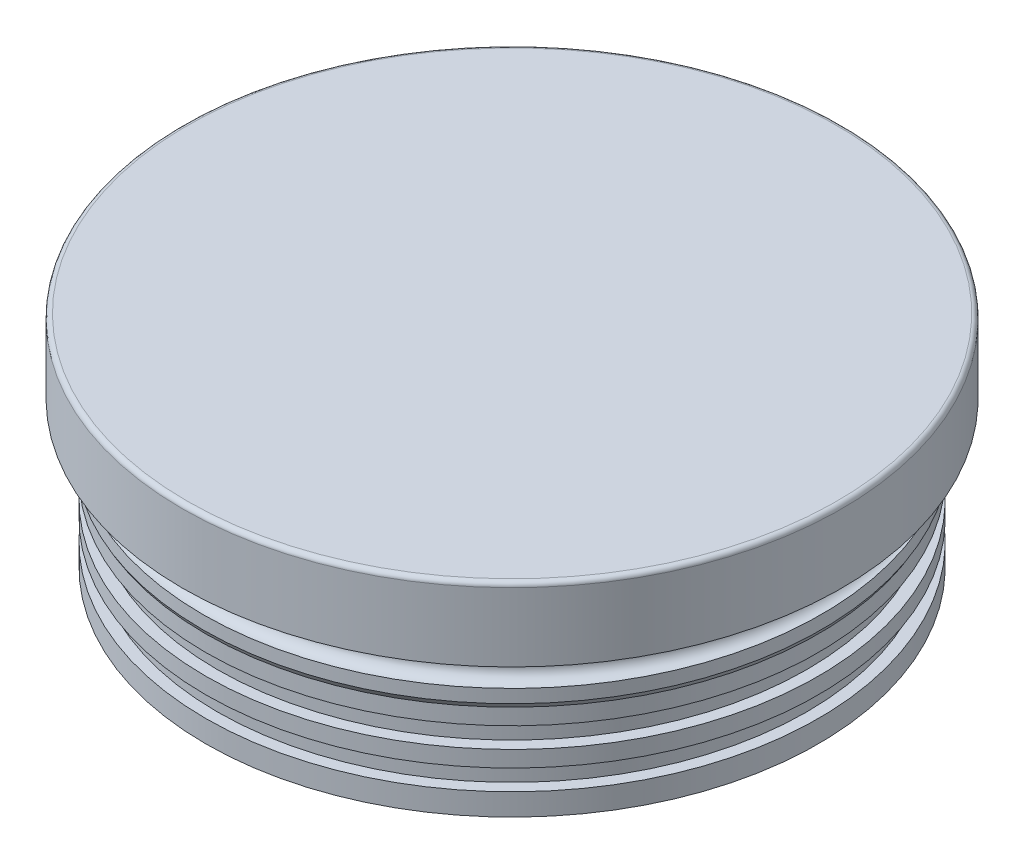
ISO-10303-21;
HEADER;
FILE_DESCRIPTION(('STEP AP214'),'2;1');
FILE_NAME('part.step','',(''),(''),'','','');
FILE_SCHEMA(('AUTOMOTIVE_DESIGN { 1 0 10303 214 1 1 1 1 }'));
ENDSEC;
DATA;
#1=APPLICATION_CONTEXT('core data for automotive mechanical design processes');
#2=APPLICATION_PROTOCOL_DEFINITION('international standard','automotive_design',2000,#1);
#3=PRODUCT_CONTEXT('',#1,'mechanical');
#4=PRODUCT('Part','Part','',(#3));
#5=PRODUCT_RELATED_PRODUCT_CATEGORY('part','',(#4));
#6=PRODUCT_DEFINITION_FORMATION('','',#4);
#7=PRODUCT_DEFINITION_CONTEXT('part definition',#1,'design');
#8=PRODUCT_DEFINITION('design','',#6,#7);
#9=PRODUCT_DEFINITION_SHAPE('','',#8);
#10=(LENGTH_UNIT() NAMED_UNIT(*) SI_UNIT(.MILLI.,.METRE.));
#11=(NAMED_UNIT(*) PLANE_ANGLE_UNIT() SI_UNIT($,.RADIAN.));
#12=(NAMED_UNIT(*) SI_UNIT($,.STERADIAN.) SOLID_ANGLE_UNIT());
#13=UNCERTAINTY_MEASURE_WITH_UNIT(LENGTH_MEASURE(1.E-05),#10,'distance_accuracy_value','');
#14=(GEOMETRIC_REPRESENTATION_CONTEXT(3) GLOBAL_UNCERTAINTY_ASSIGNED_CONTEXT((#13)) GLOBAL_UNIT_ASSIGNED_CONTEXT((#10,
#11,#12)) REPRESENTATION_CONTEXT('',''));
#15=CARTESIAN_POINT('',(0.,0.,0.));
#16=DIRECTION('',(0.,0.,1.));
#17=DIRECTION('',(1.,0.,0.));
#18=AXIS2_PLACEMENT_3D('',#15,#16,#17);
#19=CARTESIAN_POINT('',(0.,-38.1,0.));
#20=DIRECTION('',(0.,1.,0.));
#21=DIRECTION('',(0.,0.,1.));
#22=AXIS2_PLACEMENT_3D('',#19,#20,#21);
#23=CYLINDRICAL_SURFACE('',#22,57.15);
#24=CARTESIAN_POINT('',(0.,-0.787399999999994,0.));
#25=DIRECTION('',(0.,1.,0.));
#26=DIRECTION('',(0.,0.,1.));
#27=AXIS2_PLACEMENT_3D('',#24,#25,#26);
#28=CIRCLE('',#27,57.15);
#29=CARTESIAN_POINT('',(0.,-0.787399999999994,57.15));
#30=VERTEX_POINT('',#29);
#31=EDGE_CURVE('E267',#30,#30,#28,.F.);
#32=ORIENTED_EDGE('',*,*,#31,.T.);
#33=EDGE_LOOP('',(#32));
#34=FACE_BOUND('',#33,.T.);
#35=CARTESIAN_POINT('',(-57.15,-1.90499999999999,0.));
#36=CARTESIAN_POINT('',(-57.149997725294,-1.90501091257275,-0.249273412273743));
#37=CARTESIAN_POINT('',(-57.1483516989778,-1.92603920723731,-0.498717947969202));
#38=CARTESIAN_POINT('',(-57.1419436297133,-2.00961791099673,-0.990709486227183));
#39=CARTESIAN_POINT('',(-57.1371780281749,-2.07221574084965,-1.23324828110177));
#40=CARTESIAN_POINT('',(-57.1250695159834,-2.23711599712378,-1.70423127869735));
#41=CARTESIAN_POINT('',(-57.1177280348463,-2.33939640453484,-1.93268321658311));
#42=CARTESIAN_POINT('',(-57.1012917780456,-2.58072011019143,-2.36912023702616));
#43=CARTESIAN_POINT('',(-57.0921973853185,-2.71975538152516,-2.57710977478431));
#44=CARTESIAN_POINT('',(-57.073253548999,-3.03097941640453,-2.96723990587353));
#45=CARTESIAN_POINT('',(-57.0634026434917,-3.20323339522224,-3.14932840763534));
#46=CARTESIAN_POINT('',(-57.0440683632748,-3.57586806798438,-3.48204102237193));
#47=CARTESIAN_POINT('',(-57.0345850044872,-3.77624997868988,-3.6326637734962));
#48=CARTESIAN_POINT('',(-57.0170434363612,-4.1997633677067,-3.89834214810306));
#49=CARTESIAN_POINT('',(-57.0089870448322,-4.4229233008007,-4.01335254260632));
#50=CARTESIAN_POINT('',(-56.9952276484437,-4.88545942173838,-4.20425247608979));
#51=CARTESIAN_POINT('',(-56.9895246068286,-5.12483535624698,-4.28014262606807));
#52=CARTESIAN_POINT('',(-56.9811294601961,-5.61249074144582,-4.39049814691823));
#53=CARTESIAN_POINT('',(-56.9784312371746,-5.86075103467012,-4.4250477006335));
#54=CARTESIAN_POINT('',(-56.9763317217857,-6.35956060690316,-4.45200130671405));
#55=CARTESIAN_POINT('',(-56.9769303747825,-6.61010984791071,-4.44440605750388));
#56=CARTESIAN_POINT('',(-56.9813514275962,-7.10580921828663,-4.38735530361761));
#57=CARTESIAN_POINT('',(-56.9851667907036,-7.35096993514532,-4.33799116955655));
#58=CARTESIAN_POINT('',(-56.9955802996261,-7.82951533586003,-4.19894579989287));
#59=CARTESIAN_POINT('',(-57.002178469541,-8.0628999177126,-4.10926421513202));
#60=CARTESIAN_POINT('',(-57.0174222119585,-8.51156001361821,-3.89202695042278));
#61=CARTESIAN_POINT('',(-57.0260700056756,-8.72681553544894,-3.76443014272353));
#62=CARTESIAN_POINT('',(-57.0444364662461,-9.13288859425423,-3.4750141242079));
#63=CARTESIAN_POINT('',(-57.0541551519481,-9.32370570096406,-3.31319431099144));
#64=CARTESIAN_POINT('',(-57.0735995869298,-9.67601670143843,-2.95941264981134));
#65=CARTESIAN_POINT('',(-57.0833252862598,-9.83743126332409,-2.76737178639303));
#66=CARTESIAN_POINT('',(-57.1016631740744,-10.1257422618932,-2.35887541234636));
#67=CARTESIAN_POINT('',(-57.1102753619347,-10.2526386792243,-2.14241988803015));
#68=CARTESIAN_POINT('',(-57.125417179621,-10.4683058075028,-1.69118801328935));
#69=CARTESIAN_POINT('',(-57.1319466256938,-10.5570731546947,-1.45641004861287));
#70=CARTESIAN_POINT('',(-57.142185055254,-10.6939075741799,-0.975220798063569));
#71=CARTESIAN_POINT('',(-57.1458940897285,-10.7419753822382,-0.728809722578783));
#72=CARTESIAN_POINT('',(-57.1500672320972,-10.7959471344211,-0.23203678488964));
#73=CARTESIAN_POINT('',(-57.1505397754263,-10.8019606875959,0.0183131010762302));
#74=CARTESIAN_POINT('',(-57.1482091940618,-10.7719401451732,0.516461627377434));
#75=CARTESIAN_POINT('',(-57.1454060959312,-10.7359063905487,0.764260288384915));
#76=CARTESIAN_POINT('',(-57.1368449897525,-10.6229049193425,1.24996084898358));
#77=CARTESIAN_POINT('',(-57.1310906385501,-10.5459878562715,1.48787460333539));
#78=CARTESIAN_POINT('',(-57.117273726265,-10.3534548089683,1.94741868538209));
#79=CARTESIAN_POINT('',(-57.1092111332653,-10.2378382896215,2.16904878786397));
#80=CARTESIAN_POINT('',(-57.0916611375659,-9.9709117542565,2.59023404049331));
#81=CARTESIAN_POINT('',(-57.0821708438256,-9.81952894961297,2.78974293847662));
#82=CARTESIAN_POINT('',(-57.0628419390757,-9.48547242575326,3.16055594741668));
#83=CARTESIAN_POINT('',(-57.0530033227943,-9.30279823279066,3.33185963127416));
#84=CARTESIAN_POINT('',(-57.0340618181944,-8.91086954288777,3.64177413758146));
#85=CARTESIAN_POINT('',(-57.0249605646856,-8.70155849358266,3.78031355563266));
#86=CARTESIAN_POINT('',(-57.0085466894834,-8.26257994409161,4.02027766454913));
#87=CARTESIAN_POINT('',(-57.0012340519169,-8.03291262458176,4.12170268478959));
#88=CARTESIAN_POINT('',(-56.9892340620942,-7.55999612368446,4.28443668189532));
#89=CARTESIAN_POINT('',(-56.9845438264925,-7.3167621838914,4.34578973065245));
#90=CARTESIAN_POINT('',(-56.9783097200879,-6.82340737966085,4.42678182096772));
#91=CARTESIAN_POINT('',(-56.9767657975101,-6.57328662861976,4.44642154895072));
#92=CARTESIAN_POINT('',(-56.9769997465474,-6.07396787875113,4.44342200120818));
#93=CARTESIAN_POINT('',(-56.9787688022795,-5.82476919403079,4.42089493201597));
#94=CARTESIAN_POINT('',(-56.9854106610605,-5.33370537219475,4.33443483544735));
#95=CARTESIAN_POINT('',(-56.9902834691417,-5.09184024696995,4.27050174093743));
#96=CARTESIAN_POINT('',(-57.0025814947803,-4.62229929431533,4.10307200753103));
#97=CARTESIAN_POINT('',(-57.0100066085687,-4.3946228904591,3.99957697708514));
#98=CARTESIAN_POINT('',(-57.0265727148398,-3.9598594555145,3.75597434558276));
#99=CARTESIAN_POINT('',(-57.0357136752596,-3.75277203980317,3.61586742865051));
#100=CARTESIAN_POINT('',(-57.0547103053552,-3.36449165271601,3.3025974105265));
#101=CARTESIAN_POINT('',(-57.0645677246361,-3.18336551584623,3.12935157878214));
#102=CARTESIAN_POINT('',(-57.0838707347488,-2.85269400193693,2.75486436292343));
#103=CARTESIAN_POINT('',(-57.0933162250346,-2.70315630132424,2.55361619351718));
#104=CARTESIAN_POINT('',(-57.1107459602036,-2.43973314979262,2.12849662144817));
#105=CARTESIAN_POINT('',(-57.1187277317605,-2.3259078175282,1.90458790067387));
#106=CARTESIAN_POINT('',(-57.1323007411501,-2.1376119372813,1.44093050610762));
#107=CARTESIAN_POINT('',(-57.137894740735,-2.06309589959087,1.20120050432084));
#108=CARTESIAN_POINT('',(-57.1446170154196,-1.97462674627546,0.800033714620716));
#109=CARTESIAN_POINT('',(-57.1466265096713,-1.94855114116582,0.641180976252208));
#110=CARTESIAN_POINT('',(-57.1493187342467,-1.91373426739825,0.321575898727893));
#111=CARTESIAN_POINT('',(-57.1500014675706,-1.90499295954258,0.160823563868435));
#112=CARTESIAN_POINT('',(-57.15,-1.90499999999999,0.));
#113=B_SPLINE_CURVE_WITH_KNOTS('',3,(#35,#36,#37,#38,#39,#40,#41,#42,#43,#44,#45,#46,#47,#48,
#49,#50,#51,#52,#53,#54,#55,#56,#57,#58,#59,#60,#61,#62,#63,#64,#65,#66,#67,#68,#69,#70,#71,#72,
#73,#74,#75,#76,#77,#78,#79,#80,#81,#82,#83,#84,#85,#86,#87,#88,#89,#90,#91,#92,#93,#94,#95,#96,
#97,#98,#99,#100,#101,#102,#103,#104,#105,#106,#107,#108,#109,#110,#111,#112),.UNSPECIFIED.,.T.,
.F.,(4,2,2,2,2,2,2,2,2,2,2,2,2,2,2,2,2,2,2,2,2,2,2,2,2,2,2,2,2,2,2,2,2,2,2,2,2,2,4),(0.,
0.747233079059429,1.49532003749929,2.24299249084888,2.9905017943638,3.73949383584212,
4.48851828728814,5.23849016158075,5.98845032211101,6.73688070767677,7.48529869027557,
8.23208370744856,8.97887519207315,9.72647971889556,10.4740974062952,11.2237033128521,
11.9733096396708,12.7229820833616,13.4726409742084,14.2203452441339,14.9680434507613,
15.7148174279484,16.4616017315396,17.2099191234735,17.9582478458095,18.70819270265,
19.4581309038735,20.2072429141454,20.9563425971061,21.7034517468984,22.4505621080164,
23.197642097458,23.9447081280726,24.6936641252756,25.4428019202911,26.1931941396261,
26.9427160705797,27.4248090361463,27.9069009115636),.UNSPECIFIED.);
#114=CARTESIAN_POINT('',(-57.15,-1.90499999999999,0.));
#115=VERTEX_POINT('',#114);
#116=EDGE_CURVE('E96',#115,#115,#113,.T.);
#117=ORIENTED_EDGE('',*,*,#116,.F.);
#118=EDGE_LOOP('',(#117));
#119=FACE_BOUND('',#118,.T.);
#120=CARTESIAN_POINT('',(0.,-12.7,0.));
#121=DIRECTION('',(0.,1.,0.));
#122=DIRECTION('',(0.,0.,1.));
#123=AXIS2_PLACEMENT_3D('',#120,#121,#122);
#124=CIRCLE('',#123,57.15);
#125=CARTESIAN_POINT('',(0.,-12.7,57.15));
#126=VERTEX_POINT('',#125);
#127=EDGE_CURVE('E131',#126,#126,#124,.T.);
#128=ORIENTED_EDGE('',*,*,#127,.T.);
#129=EDGE_LOOP('',(#128));
#130=FACE_BOUND('',#129,.T.);
#131=ADVANCED_FACE('F40',(#34,#119,#130),#23,.T.);
#132=CARTESIAN_POINT('',(0.,0.,0.));
#133=DIRECTION('',(0.,1.,0.));
#134=DIRECTION('',(0.,0.,1.));
#135=AXIS2_PLACEMENT_3D('',#132,#133,#134);
#136=PLANE('',#135);
#137=CARTESIAN_POINT('',(0.,0.,0.));
#138=DIRECTION('',(0.,1.,0.));
#139=DIRECTION('',(0.,0.,1.));
#140=AXIS2_PLACEMENT_3D('',#137,#138,#139);
#141=CIRCLE('',#140,56.3626);
#142=CARTESIAN_POINT('',(0.,0.,56.3626));
#143=VERTEX_POINT('',#142);
#144=EDGE_CURVE('E149',#143,#143,#141,.T.);
#145=ORIENTED_EDGE('',*,*,#144,.T.);
#146=EDGE_LOOP('',(#145));
#147=FACE_BOUND('',#146,.T.);
#148=ADVANCED_FACE('F254',(#147),#136,.T.);
#149=CARTESIAN_POINT('',(0.,0.,0.));
#150=DIRECTION('',(0.,1.,0.));
#151=DIRECTION('',(0.,0.,1.));
#152=AXIS2_PLACEMENT_3D('',#149,#150,#151);
#153=CYLINDRICAL_SURFACE('',#152,53.1114);
#154=CARTESIAN_POINT('',(0.,-21.59,0.));
#155=DIRECTION('',(0.,1.,0.));
#156=DIRECTION('',(0.,0.,1.));
#157=AXIS2_PLACEMENT_3D('',#154,#155,#156);
#158=CIRCLE('',#157,53.1114);
#159=CARTESIAN_POINT('',(0.,-21.59,53.1114));
#160=VERTEX_POINT('',#159);
#161=EDGE_CURVE('E146',#160,#160,#158,.T.);
#162=ORIENTED_EDGE('',*,*,#161,.F.);
#163=EDGE_LOOP('',(#162));
#164=FACE_BOUND('',#163,.T.);
#165=CARTESIAN_POINT('',(0.,-24.384,0.));
#166=DIRECTION('',(0.,1.,0.));
#167=DIRECTION('',(0.,0.,1.));
#168=AXIS2_PLACEMENT_3D('',#165,#166,#167);
#169=CIRCLE('',#168,53.1114);
#170=CARTESIAN_POINT('',(0.,-24.384,53.1114));
#171=VERTEX_POINT('',#170);
#172=EDGE_CURVE('E104',#171,#171,#169,.T.);
#173=ORIENTED_EDGE('',*,*,#172,.T.);
#174=EDGE_LOOP('',(#173));
#175=FACE_BOUND('',#174,.T.);
#176=ADVANCED_FACE('F250',(#164,#175),#153,.T.);
#177=CARTESIAN_POINT('',(0.,-21.59,0.));
#178=DIRECTION('',(0.,1.,0.));
#179=DIRECTION('',(0.,0.,1.));
#180=AXIS2_PLACEMENT_3D('',#177,#178,#179);
#181=CONICAL_SURFACE('',#180,53.1114,0.523598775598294);
#182=CARTESIAN_POINT('',(0.,-20.710118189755,0.));
#183=DIRECTION('',(0.,1.,0.));
#184=DIRECTION('',(0.,0.,1.));
#185=AXIS2_PLACEMENT_3D('',#182,#183,#184);
#186=CIRCLE('',#185,53.6194);
#187=CARTESIAN_POINT('',(0.,-20.710118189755,53.6194));
#188=VERTEX_POINT('',#187);
#189=EDGE_CURVE('E143',#188,#188,#186,.T.);
#190=ORIENTED_EDGE('',*,*,#189,.F.);
#191=EDGE_LOOP('',(#190));
#192=FACE_BOUND('',#191,.T.);
#193=ORIENTED_EDGE('',*,*,#161,.T.);
#194=EDGE_LOOP('',(#193));
#195=FACE_BOUND('',#194,.T.);
#196=ADVANCED_FACE('F246',(#192,#195),#181,.T.);
#197=CARTESIAN_POINT('',(0.,0.,0.));
#198=DIRECTION('',(0.,1.,0.));
#199=DIRECTION('',(0.,0.,1.));
#200=AXIS2_PLACEMENT_3D('',#197,#198,#199);
#201=CYLINDRICAL_SURFACE('',#200,53.6194);
#202=CARTESIAN_POINT('',(0.,-18.415,0.));
#203=DIRECTION('',(0.,1.,0.));
#204=DIRECTION('',(0.,0.,1.));
#205=AXIS2_PLACEMENT_3D('',#202,#203,#204);
#206=CIRCLE('',#205,53.6194);
#207=CARTESIAN_POINT('',(0.,-18.415,53.6194));
#208=VERTEX_POINT('',#207);
#209=EDGE_CURVE('E140',#208,#208,#206,.T.);
#210=ORIENTED_EDGE('',*,*,#209,.F.);
#211=EDGE_LOOP('',(#210));
#212=FACE_BOUND('',#211,.T.);
#213=ORIENTED_EDGE('',*,*,#189,.T.);
#214=EDGE_LOOP('',(#213));
#215=FACE_BOUND('',#214,.T.);
#216=ADVANCED_FACE('F242',(#212,#215),#201,.T.);
#217=CARTESIAN_POINT('',(0.,-16.51,0.));
#218=DIRECTION('',(0.,1.,0.));
#219=DIRECTION('',(0.,0.,1.));
#220=AXIS2_PLACEMENT_3D('',#217,#218,#219);
#221=TOROIDAL_SURFACE('',#220,53.6194,1.905);
#222=CARTESIAN_POINT('',(0.,-14.605,0.));
#223=DIRECTION('',(0.,1.,0.));
#224=DIRECTION('',(0.,0.,1.));
#225=AXIS2_PLACEMENT_3D('',#222,#223,#224);
#226=CIRCLE('',#225,53.6194);
#227=CARTESIAN_POINT('',(0.,-14.605,53.6194));
#228=VERTEX_POINT('',#227);
#229=EDGE_CURVE('E137',#228,#228,#226,.T.);
#230=ORIENTED_EDGE('',*,*,#229,.F.);
#231=EDGE_LOOP('',(#230));
#232=FACE_BOUND('',#231,.T.);
#233=ORIENTED_EDGE('',*,*,#209,.T.);
#234=EDGE_LOOP('',(#233));
#235=FACE_BOUND('',#234,.T.);
#236=ADVANCED_FACE('F238',(#232,#235),#221,.F.);
#237=CARTESIAN_POINT('',(0.,0.,0.));
#238=DIRECTION('',(0.,1.,0.));
#239=DIRECTION('',(0.,0.,1.));
#240=AXIS2_PLACEMENT_3D('',#237,#238,#239);
#241=CYLINDRICAL_SURFACE('',#240,53.6194);
#242=CARTESIAN_POINT('',(0.,-12.7,0.));
#243=DIRECTION('',(0.,1.,0.));
#244=DIRECTION('',(0.,0.,1.));
#245=AXIS2_PLACEMENT_3D('',#242,#243,#244);
#246=CIRCLE('',#245,53.6194);
#247=CARTESIAN_POINT('',(0.,-12.7,53.6194));
#248=VERTEX_POINT('',#247);
#249=EDGE_CURVE('E134',#248,#248,#246,.T.);
#250=ORIENTED_EDGE('',*,*,#249,.F.);
#251=EDGE_LOOP('',(#250));
#252=FACE_BOUND('',#251,.T.);
#253=ORIENTED_EDGE('',*,*,#229,.T.);
#254=EDGE_LOOP('',(#253));
#255=FACE_BOUND('',#254,.T.);
#256=ADVANCED_FACE('F234',(#252,#255),#241,.T.);
#257=CARTESIAN_POINT('',(-57.15,-12.7,0.));
#258=DIRECTION('',(0.,1.,0.));
#259=DIRECTION('',(0.,0.,1.));
#260=AXIS2_PLACEMENT_3D('',#257,#258,#259);
#261=PLANE('',#260);
#262=ORIENTED_EDGE('',*,*,#127,.F.);
#263=EDGE_LOOP('',(#262));
#264=FACE_BOUND('',#263,.T.);
#265=ORIENTED_EDGE('',*,*,#249,.T.);
#266=EDGE_LOOP('',(#265));
#267=FACE_BOUND('',#266,.T.);
#268=ADVANCED_FACE('F230',(#264,#267),#261,.F.);
#269=CARTESIAN_POINT('',(0.,0.,0.));
#270=DIRECTION('',(0.,1.,0.));
#271=DIRECTION('',(0.,0.,1.));
#272=AXIS2_PLACEMENT_3D('',#269,#270,#271);
#273=CYLINDRICAL_SURFACE('',#272,53.1114);
#274=CARTESIAN_POINT('',(0.,-34.29,0.));
#275=DIRECTION('',(0.,1.,0.));
#276=DIRECTION('',(0.,0.,1.));
#277=AXIS2_PLACEMENT_3D('',#274,#275,#276);
#278=CIRCLE('',#277,53.1114);
#279=CARTESIAN_POINT('',(0.,-34.29,53.1114));
#280=VERTEX_POINT('',#279);
#281=EDGE_CURVE('E125',#280,#280,#278,.T.);
#282=ORIENTED_EDGE('',*,*,#281,.F.);
#283=EDGE_LOOP('',(#282));
#284=FACE_BOUND('',#283,.T.);
#285=CARTESIAN_POINT('',(0.,-38.1,0.));
#286=DIRECTION('',(0.,1.,0.));
#287=DIRECTION('',(0.,0.,1.));
#288=AXIS2_PLACEMENT_3D('',#285,#286,#287);
#289=CIRCLE('',#288,53.1114);
#290=CARTESIAN_POINT('',(0.,-38.1,53.1114));
#291=VERTEX_POINT('',#290);
#292=EDGE_CURVE('E128',#291,#291,#289,.T.);
#293=ORIENTED_EDGE('',*,*,#292,.T.);
#294=EDGE_LOOP('',(#293));
#295=FACE_BOUND('',#294,.T.);
#296=ADVANCED_FACE('F226',(#284,#295),#273,.T.);
#297=CARTESIAN_POINT('',(-53.1114,-34.29,0.));
#298=DIRECTION('',(0.,-1.,0.));
#299=DIRECTION('',(0.,0.,-1.));
#300=AXIS2_PLACEMENT_3D('',#297,#298,#299);
#301=PLANE('',#300);
#302=CARTESIAN_POINT('',(0.,-34.29,0.));
#303=DIRECTION('',(0.,1.,0.));
#304=DIRECTION('',(0.,0.,1.));
#305=AXIS2_PLACEMENT_3D('',#302,#303,#304);
#306=CIRCLE('',#305,51.1175);
#307=CARTESIAN_POINT('',(0.,-34.29,51.1175));
#308=VERTEX_POINT('',#307);
#309=EDGE_CURVE('E122',#308,#308,#306,.T.);
#310=ORIENTED_EDGE('',*,*,#309,.F.);
#311=EDGE_LOOP('',(#310));
#312=FACE_BOUND('',#311,.T.);
#313=ORIENTED_EDGE('',*,*,#281,.T.);
#314=EDGE_LOOP('',(#313));
#315=FACE_BOUND('',#314,.T.);
#316=ADVANCED_FACE('F222',(#312,#315),#301,.F.);
#317=CARTESIAN_POINT('',(0.,0.,0.));
#318=DIRECTION('',(0.,1.,0.));
#319=DIRECTION('',(0.,0.,1.));
#320=AXIS2_PLACEMENT_3D('',#317,#318,#319);
#321=CYLINDRICAL_SURFACE('',#320,51.1175);
#322=CARTESIAN_POINT('',(0.,-30.734,0.));
#323=DIRECTION('',(0.,1.,0.));
#324=DIRECTION('',(0.,0.,1.));
#325=AXIS2_PLACEMENT_3D('',#322,#323,#324);
#326=CIRCLE('',#325,51.1175);
#327=CARTESIAN_POINT('',(0.,-30.734,51.1175));
#328=VERTEX_POINT('',#327);
#329=EDGE_CURVE('E119',#328,#328,#326,.T.);
#330=ORIENTED_EDGE('',*,*,#329,.F.);
#331=EDGE_LOOP('',(#330));
#332=FACE_BOUND('',#331,.T.);
#333=ORIENTED_EDGE('',*,*,#309,.T.);
#334=EDGE_LOOP('',(#333));
#335=FACE_BOUND('',#334,.T.);
#336=ADVANCED_FACE('F218',(#332,#335),#321,.T.);
#337=CARTESIAN_POINT('',(-53.1114,-30.734,0.));
#338=DIRECTION('',(0.,1.,0.));
#339=DIRECTION('',(0.,0.,1.));
#340=AXIS2_PLACEMENT_3D('',#337,#338,#339);
#341=PLANE('',#340);
#342=CARTESIAN_POINT('',(0.,-30.734,0.));
#343=DIRECTION('',(0.,1.,0.));
#344=DIRECTION('',(0.,0.,1.));
#345=AXIS2_PLACEMENT_3D('',#342,#343,#344);
#346=CIRCLE('',#345,53.1114);
#347=CARTESIAN_POINT('',(0.,-30.734,53.1114));
#348=VERTEX_POINT('',#347);
#349=EDGE_CURVE('E116',#348,#348,#346,.T.);
#350=ORIENTED_EDGE('',*,*,#349,.F.);
#351=EDGE_LOOP('',(#350));
#352=FACE_BOUND('',#351,.T.);
#353=ORIENTED_EDGE('',*,*,#329,.T.);
#354=EDGE_LOOP('',(#353));
#355=FACE_BOUND('',#354,.T.);
#356=ADVANCED_FACE('F214',(#352,#355),#341,.F.);
#357=CARTESIAN_POINT('',(0.,0.,0.));
#358=DIRECTION('',(0.,1.,0.));
#359=DIRECTION('',(0.,0.,1.));
#360=AXIS2_PLACEMENT_3D('',#357,#358,#359);
#361=CYLINDRICAL_SURFACE('',#360,53.1114);
#362=CARTESIAN_POINT('',(0.,-27.94,0.));
#363=DIRECTION('',(0.,1.,0.));
#364=DIRECTION('',(0.,0.,1.));
#365=AXIS2_PLACEMENT_3D('',#362,#363,#364);
#366=CIRCLE('',#365,53.1114);
#367=CARTESIAN_POINT('',(0.,-27.94,53.1114));
#368=VERTEX_POINT('',#367);
#369=EDGE_CURVE('E113',#368,#368,#366,.T.);
#370=ORIENTED_EDGE('',*,*,#369,.F.);
#371=EDGE_LOOP('',(#370));
#372=FACE_BOUND('',#371,.T.);
#373=ORIENTED_EDGE('',*,*,#349,.T.);
#374=EDGE_LOOP('',(#373));
#375=FACE_BOUND('',#374,.T.);
#376=ADVANCED_FACE('F210',(#372,#375),#361,.T.);
#377=CARTESIAN_POINT('',(-53.1114,-27.94,0.));
#378=DIRECTION('',(0.,-1.,0.));
#379=DIRECTION('',(0.,0.,-1.));
#380=AXIS2_PLACEMENT_3D('',#377,#378,#379);
#381=PLANE('',#380);
#382=CARTESIAN_POINT('',(0.,-27.94,0.));
#383=DIRECTION('',(0.,1.,0.));
#384=DIRECTION('',(0.,0.,1.));
#385=AXIS2_PLACEMENT_3D('',#382,#383,#384);
#386=CIRCLE('',#385,51.1175);
#387=CARTESIAN_POINT('',(0.,-27.94,51.1175));
#388=VERTEX_POINT('',#387);
#389=EDGE_CURVE('E110',#388,#388,#386,.T.);
#390=ORIENTED_EDGE('',*,*,#389,.F.);
#391=EDGE_LOOP('',(#390));
#392=FACE_BOUND('',#391,.T.);
#393=ORIENTED_EDGE('',*,*,#369,.T.);
#394=EDGE_LOOP('',(#393));
#395=FACE_BOUND('',#394,.T.);
#396=ADVANCED_FACE('F206',(#392,#395),#381,.F.);
#397=CARTESIAN_POINT('',(0.,0.,0.));
#398=DIRECTION('',(0.,1.,0.));
#399=DIRECTION('',(0.,0.,1.));
#400=AXIS2_PLACEMENT_3D('',#397,#398,#399);
#401=CYLINDRICAL_SURFACE('',#400,51.1175);
#402=CARTESIAN_POINT('',(0.,-24.384,0.));
#403=DIRECTION('',(0.,1.,0.));
#404=DIRECTION('',(0.,0.,1.));
#405=AXIS2_PLACEMENT_3D('',#402,#403,#404);
#406=CIRCLE('',#405,51.1175);
#407=CARTESIAN_POINT('',(0.,-24.384,51.1175));
#408=VERTEX_POINT('',#407);
#409=EDGE_CURVE('E107',#408,#408,#406,.T.);
#410=ORIENTED_EDGE('',*,*,#409,.F.);
#411=EDGE_LOOP('',(#410));
#412=FACE_BOUND('',#411,.T.);
#413=ORIENTED_EDGE('',*,*,#389,.T.);
#414=EDGE_LOOP('',(#413));
#415=FACE_BOUND('',#414,.T.);
#416=ADVANCED_FACE('F202',(#412,#415),#401,.T.);
#417=CARTESIAN_POINT('',(-53.1114,-24.384,0.));
#418=DIRECTION('',(0.,1.,0.));
#419=DIRECTION('',(0.,0.,1.));
#420=AXIS2_PLACEMENT_3D('',#417,#418,#419);
#421=PLANE('',#420);
#422=ORIENTED_EDGE('',*,*,#172,.F.);
#423=EDGE_LOOP('',(#422));
#424=FACE_BOUND('',#423,.T.);
#425=ORIENTED_EDGE('',*,*,#409,.T.);
#426=EDGE_LOOP('',(#425));
#427=FACE_BOUND('',#426,.T.);
#428=ADVANCED_FACE('F199',(#424,#427),#421,.F.);
#429=CARTESIAN_POINT('',(0.,-38.1,0.));
#430=DIRECTION('',(0.,1.,0.));
#431=DIRECTION('',(0.,0.,1.));
#432=AXIS2_PLACEMENT_3D('',#429,#430,#431);
#433=PLANE('',#432);
#434=CARTESIAN_POINT('',(0.,-38.1,0.));
#435=DIRECTION('',(0.,1.,0.));
#436=DIRECTION('',(0.,0.,1.));
#437=AXIS2_PLACEMENT_3D('',#434,#435,#436);
#438=CIRCLE('',#437,49.4624865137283);
#439=CARTESIAN_POINT('',(0.,-38.1,49.4624865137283));
#440=VERTEX_POINT('',#439);
#441=EDGE_CURVE('E49',#440,#440,#438,.T.);
#442=ORIENTED_EDGE('',*,*,#441,.T.);
#443=EDGE_LOOP('',(#442));
#444=FACE_BOUND('',#443,.T.);
#445=ORIENTED_EDGE('',*,*,#292,.F.);
#446=EDGE_LOOP('',(#445));
#447=FACE_BOUND('',#446,.T.);
#448=ADVANCED_FACE('F197',(#444,#447),#433,.F.);
#449=CARTESIAN_POINT('',(0.,-9.52500000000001,0.));
#450=DIRECTION('',(0.,1.,0.));
#451=DIRECTION('',(0.,0.,1.));
#452=AXIS2_PLACEMENT_3D('',#449,#450,#451);
#453=PLANE('',#452);
#454=CARTESIAN_POINT('',(0.,-9.52500000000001,0.));
#455=DIRECTION('',(0.,1.,0.));
#456=DIRECTION('',(0.,0.,1.));
#457=AXIS2_PLACEMENT_3D('',#454,#455,#456);
#458=CIRCLE('',#457,34.925);
#459=CARTESIAN_POINT('',(-34.9159801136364,-9.52500000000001,0.793698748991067));
#460=VERTEX_POINT('',#459);
#461=CARTESIAN_POINT('',(-34.9159801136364,-9.52500000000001,-0.793698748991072));
#462=VERTEX_POINT('',#461);
#463=EDGE_CURVE('E100',#460,#462,#458,.T.);
#464=ORIENTED_EDGE('',*,*,#463,.F.);
#465=CARTESIAN_POINT('',(-34.925,-9.52500000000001,0.));
#466=DIRECTION('',(0.,-1.,0.));
#467=DIRECTION('',(0.,0.,-1.));
#468=AXIS2_PLACEMENT_3D('',#465,#466,#467);
#469=CIRCLE('',#468,0.79375);
#470=EDGE_CURVE('E55',#462,#460,#469,.T.);
#471=ORIENTED_EDGE('',*,*,#470,.F.);
#472=EDGE_LOOP('',(#464,#471));
#473=FACE_BOUND('',#472,.T.);
#474=ADVANCED_FACE('F193',(#473),#453,.F.);
#475=CARTESIAN_POINT('',(0.,-22.225,0.));
#476=DIRECTION('',(0.,1.,0.));
#477=DIRECTION('',(0.,0.,1.));
#478=AXIS2_PLACEMENT_3D('',#475,#476,#477);
#479=TOROIDAL_SURFACE('',#478,34.925,12.7);
#480=CARTESIAN_POINT('',(0.,-22.225,0.));
#481=DIRECTION('',(0.,1.,0.));
#482=DIRECTION('',(0.,0.,1.));
#483=AXIS2_PLACEMENT_3D('',#480,#481,#482);
#484=CIRCLE('',#483,47.625);
#485=CARTESIAN_POINT('',(0.,-22.225,47.625));
#486=VERTEX_POINT('',#485);
#487=EDGE_CURVE('E97',#486,#486,#484,.T.);
#488=ORIENTED_EDGE('',*,*,#487,.F.);
#489=EDGE_LOOP('',(#488));
#490=FACE_BOUND('',#489,.T.);
#491=EDGE_CURVE('E101',#462,#460,#458,.T.);
#492=ORIENTED_EDGE('',*,*,#491,.T.);
#493=ORIENTED_EDGE('',*,*,#463,.T.);
#494=EDGE_LOOP('',(#492,#493));
#495=FACE_BOUND('',#494,.T.);
#496=ADVANCED_FACE('F189',(#490,#495),#479,.F.);
#497=CARTESIAN_POINT('',(0.,-38.1,0.));
#498=DIRECTION('',(0.,1.,0.));
#499=DIRECTION('',(0.,0.,1.));
#500=AXIS2_PLACEMENT_3D('',#497,#498,#499);
#501=CYLINDRICAL_SURFACE('',#500,47.625);
#502=CARTESIAN_POINT('',(0.,-34.91738,0.));
#503=DIRECTION('',(0.,1.,0.));
#504=DIRECTION('',(0.,0.,1.));
#505=AXIS2_PLACEMENT_3D('',#502,#503,#504);
#506=CIRCLE('',#505,47.625);
#507=CARTESIAN_POINT('',(0.,-34.91738,47.625));
#508=VERTEX_POINT('',#507);
#509=EDGE_CURVE('E11',#508,#508,#506,.F.);
#510=ORIENTED_EDGE('',*,*,#509,.T.);
#511=EDGE_LOOP('',(#510));
#512=FACE_BOUND('',#511,.T.);
#513=ORIENTED_EDGE('',*,*,#487,.T.);
#514=EDGE_LOOP('',(#513));
#515=FACE_BOUND('',#514,.T.);
#516=ADVANCED_FACE('F185',(#512,#515),#501,.F.);
#517=CARTESIAN_POINT('',(-31.2984668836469,-6.34999999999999,0.));
#518=DIRECTION('',(-1.,0.,0.));
#519=DIRECTION('',(0.,-1.,0.));
#520=AXIS2_PLACEMENT_3D('',#517,#518,#519);
#521=CONICAL_SURFACE('',#520,0.,1.02974425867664);
#522=CARTESIAN_POINT('',(-31.7754,-6.34999999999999,0.));
#523=DIRECTION('',(1.,0.,0.));
#524=DIRECTION('',(0.,1.,0.));
#525=AXIS2_PLACEMENT_3D('',#522,#523,#524);
#526=CIRCLE('',#525,0.793749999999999);
#527=CARTESIAN_POINT('',(-31.7754,-5.55625,0.));
#528=VERTEX_POINT('',#527);
#529=EDGE_CURVE('E93',#528,#528,#526,.T.);
#530=ORIENTED_EDGE('',*,*,#529,.F.);
#531=EDGE_LOOP('',(#530));
#532=FACE_BOUND('',#531,.T.);
#533=CARTESIAN_POINT('',(-31.2984668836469,-6.34999999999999,0.));
#534=VERTEX_POINT('',#533);
#535=VERTEX_LOOP('',#534);
#536=FACE_BOUND('',#535,.T.);
#537=ADVANCED_FACE('F182',(#532,#536),#521,.F.);
#538=CARTESIAN_POINT('',(-57.1754,-6.34999999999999,0.));
#539=DIRECTION('',(1.,0.,0.));
#540=DIRECTION('',(0.,1.,0.));
#541=AXIS2_PLACEMENT_3D('',#538,#539,#540);
#542=CYLINDRICAL_SURFACE('',#541,0.793749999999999);
#543=CARTESIAN_POINT('',(-34.925,-6.34999999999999,0.));
#544=DIRECTION('',(-0.707106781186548,-0.707106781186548,0.));
#545=DIRECTION('',(0.707106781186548,-0.707106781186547,0.));
#546=AXIS2_PLACEMENT_3D('',#543,#544,#545);
#547=ELLIPSE('',#546,1.12253201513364,0.793749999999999);
#548=CARTESIAN_POINT('',(-34.925,-6.34999999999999,0.793750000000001));
#549=VERTEX_POINT('',#548);
#550=CARTESIAN_POINT('',(-34.925,-6.34999999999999,-0.793750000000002));
#551=VERTEX_POINT('',#550);
#552=EDGE_CURVE('E71',#549,#551,#547,.F.);
#553=ORIENTED_EDGE('',*,*,#552,.F.);
#554=CARTESIAN_POINT('',(-34.925,-6.34999999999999,0.));
#555=DIRECTION('',(0.707106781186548,-0.707106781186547,0.));
#556=DIRECTION('',(-0.707106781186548,-0.707106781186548,0.));
#557=AXIS2_PLACEMENT_3D('',#554,#555,#556);
#558=ELLIPSE('',#557,1.12253201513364,0.793749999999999);
#559=EDGE_CURVE('E62',#551,#549,#558,.F.);
#560=ORIENTED_EDGE('',*,*,#559,.F.);
#561=EDGE_LOOP('',(#553,#560));
#562=FACE_BOUND('',#561,.T.);
#563=CARTESIAN_POINT('',(-37.5645266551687,-6.34999999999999,0.));
#564=DIRECTION('',(1.,0.,0.));
#565=DIRECTION('',(0.,1.,0.));
#566=AXIS2_PLACEMENT_3D('',#563,#564,#565);
#567=CIRCLE('',#566,0.79375);
#568=CARTESIAN_POINT('',(-37.5645266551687,-5.55625,0.));
#569=VERTEX_POINT('',#568);
#570=EDGE_CURVE('E90',#569,#569,#567,.T.);
#571=ORIENTED_EDGE('',*,*,#570,.F.);
#572=EDGE_LOOP('',(#571));
#573=FACE_BOUND('',#572,.T.);
#574=ORIENTED_EDGE('',*,*,#529,.T.);
#575=EDGE_LOOP('',(#574));
#576=FACE_BOUND('',#575,.T.);
#577=ADVANCED_FACE('F75',(#562,#573,#576),#542,.F.);
#578=CARTESIAN_POINT('',(-37.5645266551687,-6.34999999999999,0.));
#579=DIRECTION('',(-1.,0.,0.));
#580=DIRECTION('',(0.,-1.,0.));
#581=AXIS2_PLACEMENT_3D('',#578,#579,#580);
#582=CONICAL_SURFACE('',#581,0.793749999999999,1.02974425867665);
#583=CARTESIAN_POINT('',(-38.1254,-6.34999999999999,0.));
#584=DIRECTION('',(1.,0.,0.));
#585=DIRECTION('',(0.,1.,0.));
#586=AXIS2_PLACEMENT_3D('',#583,#584,#585);
#587=CIRCLE('',#586,1.7272);
#588=CARTESIAN_POINT('',(-38.1254,-4.6228,0.));
#589=VERTEX_POINT('',#588);
#590=EDGE_CURVE('E87',#589,#589,#587,.T.);
#591=ORIENTED_EDGE('',*,*,#590,.F.);
#592=EDGE_LOOP('',(#591));
#593=FACE_BOUND('',#592,.T.);
#594=ORIENTED_EDGE('',*,*,#570,.T.);
#595=EDGE_LOOP('',(#594));
#596=FACE_BOUND('',#595,.T.);
#597=ADVANCED_FACE('F175',(#593,#596),#582,.F.);
#598=CARTESIAN_POINT('',(-57.1754,-6.34999999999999,0.));
#599=DIRECTION('',(1.,0.,0.));
#600=DIRECTION('',(0.,1.,0.));
#601=AXIS2_PLACEMENT_3D('',#598,#599,#600);
#602=CYLINDRICAL_SURFACE('',#601,1.7272);
#603=CARTESIAN_POINT('',(-53.3654,-6.34999999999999,0.));
#604=DIRECTION('',(1.,0.,0.));
#605=DIRECTION('',(0.,1.,0.));
#606=AXIS2_PLACEMENT_3D('',#603,#604,#605);
#607=CIRCLE('',#606,1.7272);
#608=CARTESIAN_POINT('',(-53.3654,-4.6228,0.));
#609=VERTEX_POINT('',#608);
#610=EDGE_CURVE('E84',#609,#609,#607,.T.);
#611=ORIENTED_EDGE('',*,*,#610,.F.);
#612=EDGE_LOOP('',(#611));
#613=FACE_BOUND('',#612,.T.);
#614=ORIENTED_EDGE('',*,*,#590,.T.);
#615=EDGE_LOOP('',(#614));
#616=FACE_BOUND('',#615,.T.);
#617=ADVANCED_FACE('F171',(#613,#616),#602,.F.);
#618=CARTESIAN_POINT('',(-53.3654,-4.62280000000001,0.));
#619=DIRECTION('',(1.,0.,0.));
#620=DIRECTION('',(0.,1.,0.));
#621=AXIS2_PLACEMENT_3D('',#618,#619,#620);
#622=PLANE('',#621);
#623=CARTESIAN_POINT('',(-53.3654,-6.34999999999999,0.));
#624=DIRECTION('',(1.,0.,0.));
#625=DIRECTION('',(0.,1.,0.));
#626=AXIS2_PLACEMENT_3D('',#623,#624,#625);
#627=CIRCLE('',#626,4.445);
#628=CARTESIAN_POINT('',(-53.3654,-1.905,0.));
#629=VERTEX_POINT('',#628);
#630=EDGE_CURVE('E81',#629,#629,#627,.T.);
#631=ORIENTED_EDGE('',*,*,#630,.F.);
#632=EDGE_LOOP('',(#631));
#633=FACE_BOUND('',#632,.T.);
#634=ORIENTED_EDGE('',*,*,#610,.T.);
#635=EDGE_LOOP('',(#634));
#636=FACE_BOUND('',#635,.T.);
#637=ADVANCED_FACE('F166',(#633,#636),#622,.F.);
#638=CARTESIAN_POINT('',(-57.1754,-6.34999999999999,0.));
#639=DIRECTION('',(1.,0.,0.));
#640=DIRECTION('',(0.,1.,0.));
#641=AXIS2_PLACEMENT_3D('',#638,#639,#640);
#642=CYLINDRICAL_SURFACE('',#641,4.445);
#643=ORIENTED_EDGE('',*,*,#116,.T.);
#644=EDGE_LOOP('',(#643));
#645=FACE_BOUND('',#644,.T.);
#646=ORIENTED_EDGE('',*,*,#630,.T.);
#647=EDGE_LOOP('',(#646));
#648=FACE_BOUND('',#647,.T.);
#649=ADVANCED_FACE('F160',(#645,#648),#642,.F.);
#650=CARTESIAN_POINT('',(-34.925,-9.52500000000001,0.));
#651=DIRECTION('',(0.,-1.,0.));
#652=DIRECTION('',(0.,0.,-1.));
#653=AXIS2_PLACEMENT_3D('',#650,#651,#652);
#654=PLANE('',#653);
#655=ORIENTED_EDGE('',*,*,#491,.F.);
#656=EDGE_CURVE('E77',#460,#462,#469,.T.);
#657=ORIENTED_EDGE('',*,*,#656,.F.);
#658=EDGE_LOOP('',(#655,#657));
#659=FACE_BOUND('',#658,.T.);
#660=ADVANCED_FACE('F165',(#659),#654,.F.);
#661=CARTESIAN_POINT('',(-34.925,0.000999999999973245,0.));
#662=DIRECTION('',(0.,-1.,0.));
#663=DIRECTION('',(0.,0.,-1.));
#664=AXIS2_PLACEMENT_3D('',#661,#662,#663);
#665=CYLINDRICAL_SURFACE('',#664,0.79375);
#666=ORIENTED_EDGE('',*,*,#470,.T.);
#667=ORIENTED_EDGE('',*,*,#656,.T.);
#668=EDGE_LOOP('',(#666,#667));
#669=FACE_BOUND('',#668,.T.);
#670=ORIENTED_EDGE('',*,*,#559,.T.);
#671=ORIENTED_EDGE('',*,*,#552,.T.);
#672=EDGE_LOOP('',(#670,#671));
#673=FACE_BOUND('',#672,.T.);
#674=ADVANCED_FACE('F72',(#669,#673),#665,.F.);
#675=CARTESIAN_POINT('',(0.,-0.787399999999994,0.));
#676=DIRECTION('',(0.,1.,0.));
#677=DIRECTION('',(0.,0.,1.));
#678=AXIS2_PLACEMENT_3D('',#675,#676,#677);
#679=TOROIDAL_SURFACE('',#678,56.3626,0.7874);
#680=ORIENTED_EDGE('',*,*,#31,.F.);
#681=EDGE_LOOP('',(#680));
#682=FACE_BOUND('',#681,.T.);
#683=ORIENTED_EDGE('',*,*,#144,.F.);
#684=EDGE_LOOP('',(#683));
#685=FACE_BOUND('',#684,.T.);
#686=ADVANCED_FACE('F275',(#682,#685),#679,.T.);
#687=CARTESIAN_POINT('',(0.,-38.1,0.));
#688=DIRECTION('',(0.,-1.,0.));
#689=DIRECTION('',(0.,0.,-1.));
#690=AXIS2_PLACEMENT_3D('',#687,#688,#689);
#691=CONICAL_SURFACE('',#690,49.4624865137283,0.523598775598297);
#692=ORIENTED_EDGE('',*,*,#509,.F.);
#693=EDGE_LOOP('',(#692));
#694=FACE_BOUND('',#693,.T.);
#695=ORIENTED_EDGE('',*,*,#441,.F.);
#696=EDGE_LOOP('',(#695));
#697=FACE_BOUND('',#696,.T.);
#698=ADVANCED_FACE('F43',(#694,#697),#691,.F.);
#699=CLOSED_SHELL('',(#131,#148,#176,#196,#216,#236,#256,#268,#296,#316,#336,#356,#376,#396,
#416,#428,#448,#474,#496,#516,#537,#577,#597,#617,#637,#649,#660,#674,#686,#698));
#700=MANIFOLD_SOLID_BREP('B2',#699);
#701=ADVANCED_BREP_SHAPE_REPRESENTATION('',(#18,#700),#14);
#702=SHAPE_DEFINITION_REPRESENTATION(#9,#701);
ENDSEC;
END-ISO-10303-21;
